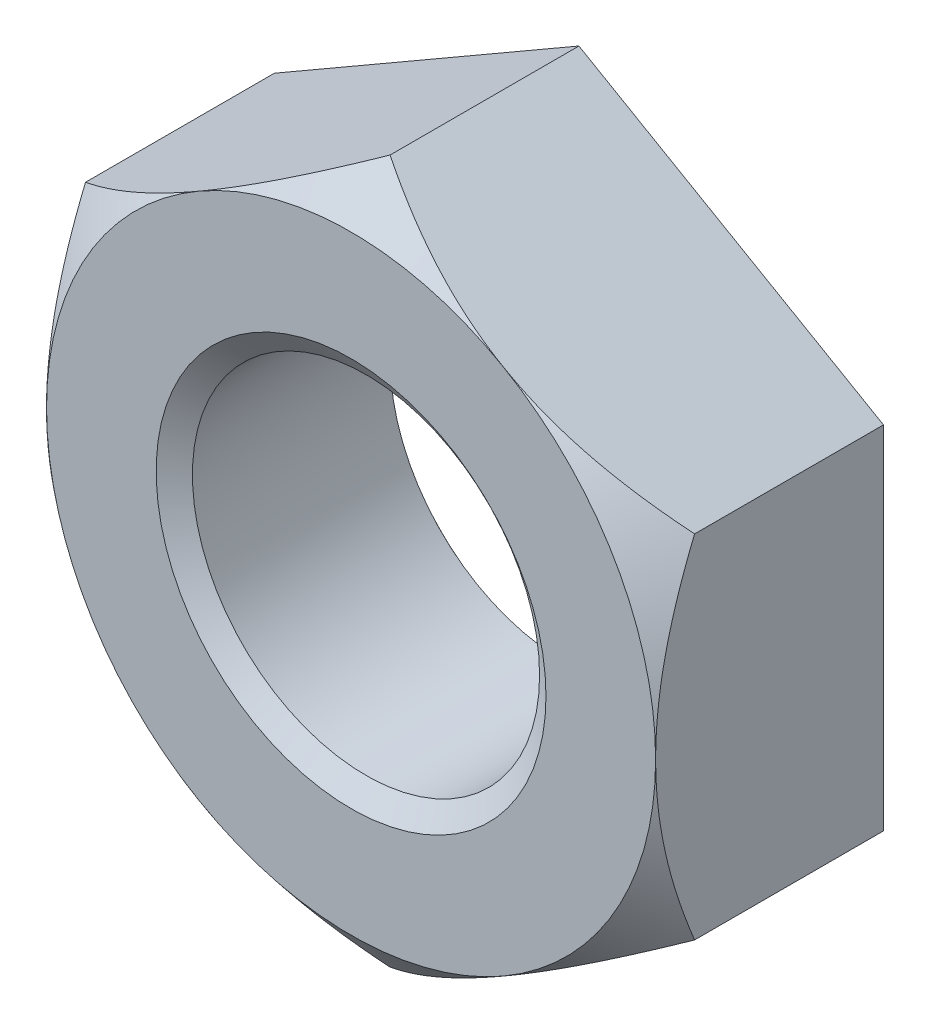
ISO-10303-21;
HEADER;
FILE_DESCRIPTION(('STEP AP214'),'2;1');
FILE_NAME('part.step','',(''),(''),'','','');
FILE_SCHEMA(('AUTOMOTIVE_DESIGN { 1 0 10303 214 1 1 1 1 }'));
ENDSEC;
DATA;
#1=APPLICATION_CONTEXT('core data for automotive mechanical design processes');
#2=APPLICATION_PROTOCOL_DEFINITION('international standard','automotive_design',2000,#1);
#3=PRODUCT_CONTEXT('',#1,'mechanical');
#4=PRODUCT('Part','Part','',(#3));
#5=PRODUCT_RELATED_PRODUCT_CATEGORY('part','',(#4));
#6=PRODUCT_DEFINITION_FORMATION('','',#4);
#7=PRODUCT_DEFINITION_CONTEXT('part definition',#1,'design');
#8=PRODUCT_DEFINITION('design','',#6,#7);
#9=PRODUCT_DEFINITION_SHAPE('','',#8);
#10=(LENGTH_UNIT() NAMED_UNIT(*) SI_UNIT(.MILLI.,.METRE.));
#11=(NAMED_UNIT(*) PLANE_ANGLE_UNIT() SI_UNIT($,.RADIAN.));
#12=(NAMED_UNIT(*) SI_UNIT($,.STERADIAN.) SOLID_ANGLE_UNIT());
#13=UNCERTAINTY_MEASURE_WITH_UNIT(LENGTH_MEASURE(1.E-05),#10,'distance_accuracy_value','');
#14=(GEOMETRIC_REPRESENTATION_CONTEXT(3) GLOBAL_UNCERTAINTY_ASSIGNED_CONTEXT((#13)) GLOBAL_UNIT_ASSIGNED_CONTEXT((#10,
#11,#12)) REPRESENTATION_CONTEXT('',''));
#15=CARTESIAN_POINT('',(0.,0.,0.));
#16=DIRECTION('',(0.,0.,1.));
#17=DIRECTION('',(1.,0.,0.));
#18=AXIS2_PLACEMENT_3D('',#15,#16,#17);
#19=CARTESIAN_POINT('',(0.,0.,-29.6926));
#20=DIRECTION('',(0.,0.,1.));
#21=DIRECTION('',(1.,0.,0.));
#22=AXIS2_PLACEMENT_3D('',#19,#20,#21);
#23=CYLINDRICAL_SURFACE('',#22,22.62124);
#24=CARTESIAN_POINT('',(0.,0.,-1.9457086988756));
#25=DIRECTION('',(0.,0.,1.));
#26=DIRECTION('',(1.,0.,0.));
#27=AXIS2_PLACEMENT_3D('',#24,#25,#26);
#28=CIRCLE('',#27,22.62124);
#29=CARTESIAN_POINT('',(22.62124,0.,-1.9457086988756));
#30=VERTEX_POINT('',#29);
#31=EDGE_CURVE('E137',#30,#30,#28,.F.);
#32=ORIENTED_EDGE('',*,*,#31,.F.);
#33=EDGE_LOOP('',(#32));
#34=FACE_BOUND('',#33,.T.);
#35=CARTESIAN_POINT('',(0.,0.,-27.7214913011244));
#36=DIRECTION('',(0.,0.,-1.));
#37=DIRECTION('',(-1.,0.,0.));
#38=AXIS2_PLACEMENT_3D('',#35,#36,#37);
#39=CIRCLE('',#38,22.62124);
#40=CARTESIAN_POINT('',(-22.62124,0.,-27.7214913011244));
#41=VERTEX_POINT('',#40);
#42=EDGE_CURVE('E44',#41,#41,#39,.F.);
#43=ORIENTED_EDGE('',*,*,#42,.F.);
#44=EDGE_LOOP('',(#43));
#45=FACE_BOUND('',#44,.T.);
#46=ADVANCED_FACE('F39',(#34,#45),#23,.F.);
#47=CARTESIAN_POINT('',(-79.3749999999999,0.,0.));
#48=DIRECTION('',(0.,0.,1.));
#49=DIRECTION('',(1.,0.,0.));
#50=AXIS2_PLACEMENT_3D('',#47,#48,#49);
#51=PLANE('',#50);
#52=CARTESIAN_POINT('',(0.,0.,0.));
#53=DIRECTION('',(0.,0.,1.));
#54=DIRECTION('',(1.,0.,0.));
#55=AXIS2_PLACEMENT_3D('',#52,#53,#54);
#56=CIRCLE('',#55,25.4);
#57=CARTESIAN_POINT('',(25.4,0.,0.));
#58=VERTEX_POINT('',#57);
#59=EDGE_CURVE('E232',#58,#58,#56,.T.);
#60=ORIENTED_EDGE('',*,*,#59,.F.);
#61=EDGE_LOOP('',(#60));
#62=FACE_BOUND('',#61,.T.);
#63=CARTESIAN_POINT('',(0.,0.,0.));
#64=DIRECTION('',(0.,0.,1.));
#65=DIRECTION('',(1.,0.,0.));
#66=AXIS2_PLACEMENT_3D('',#63,#64,#65);
#67=CIRCLE('',#66,39.6875);
#68=CARTESIAN_POINT('',(39.6875,0.,0.));
#69=VERTEX_POINT('',#68);
#70=CARTESIAN_POINT('',(19.84375,-34.3703832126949,0.));
#71=VERTEX_POINT('',#70);
#72=EDGE_CURVE('E11',#69,#71,#67,.F.);
#73=ORIENTED_EDGE('',*,*,#72,.F.);
#74=CARTESIAN_POINT('',(0.,0.,0.));
#75=DIRECTION('',(0.,0.,1.));
#76=DIRECTION('',(1.,0.,0.));
#77=AXIS2_PLACEMENT_3D('',#74,#75,#76);
#78=CIRCLE('',#77,39.6875);
#79=CARTESIAN_POINT('',(19.8437500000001,34.3703832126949,0.));
#80=VERTEX_POINT('',#79);
#81=EDGE_CURVE('E129',#69,#80,#78,.T.);
#82=ORIENTED_EDGE('',*,*,#81,.T.);
#83=CARTESIAN_POINT('',(-19.84375,34.3703832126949,0.));
#84=VERTEX_POINT('',#83);
#85=EDGE_CURVE('E51',#84,#80,#67,.F.);
#86=ORIENTED_EDGE('',*,*,#85,.F.);
#87=CARTESIAN_POINT('',(-39.6875,0.,0.));
#88=VERTEX_POINT('',#87);
#89=EDGE_CURVE('E286',#88,#84,#67,.F.);
#90=ORIENTED_EDGE('',*,*,#89,.F.);
#91=CARTESIAN_POINT('',(-19.84375,-34.3703832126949,0.));
#92=VERTEX_POINT('',#91);
#93=EDGE_CURVE('E288',#92,#88,#67,.F.);
#94=ORIENTED_EDGE('',*,*,#93,.F.);
#95=EDGE_CURVE('E49',#71,#92,#67,.F.);
#96=ORIENTED_EDGE('',*,*,#95,.F.);
#97=EDGE_LOOP('',(#73,#82,#86,#90,#94,#96));
#98=FACE_BOUND('',#97,.T.);
#99=ADVANCED_FACE('F139',(#62,#98),#51,.T.);
#100=CARTESIAN_POINT('',(0.,45.8271776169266,-29.6926));
#101=DIRECTION('',(-0.500000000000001,0.866025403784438,0.));
#102=DIRECTION('',(-0.866025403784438,-0.500000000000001,0.));
#103=AXIS2_PLACEMENT_3D('',#100,#101,#102);
#104=PLANE('',#103);
#105=CARTESIAN_POINT('',(0.000200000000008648,45.8272930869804,-5.08009554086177));
#106=CARTESIAN_POINT('',(-0.675362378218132,45.4372569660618,-4.75740980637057));
#107=CARTESIAN_POINT('',(-1.3547569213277,45.0450083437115,-4.44518483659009));
#108=CARTESIAN_POINT('',(-2.72161040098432,44.255855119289,-3.8444644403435));
#109=CARTESIAN_POINT('',(-3.40907190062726,43.8589490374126,-3.55597680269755));
#110=CARTESIAN_POINT('',(-4.79420473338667,43.0592422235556,-3.00488379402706));
#111=CARTESIAN_POINT('',(-5.49190147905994,42.6564268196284,-2.74236315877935));
#112=CARTESIAN_POINT('',(-6.89523688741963,41.8462107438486,-2.24748448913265));
#113=CARTESIAN_POINT('',(-7.60087484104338,41.4388104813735,-2.0151237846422));
#114=CARTESIAN_POINT('',(-9.01334120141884,40.6233226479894,-1.58581833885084));
#115=CARTESIAN_POINT('',(-9.72010005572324,40.2152752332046,-1.38856992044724));
#116=CARTESIAN_POINT('',(-11.1404844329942,39.3952159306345,-1.03010323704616));
#117=CARTESIAN_POINT('',(-11.8541100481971,38.9832039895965,-0.868885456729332));
#118=CARTESIAN_POINT('',(-13.2863448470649,38.1563028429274,-0.585602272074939));
#119=CARTESIAN_POINT('',(-14.0049472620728,37.7414175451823,-0.463491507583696));
#120=CARTESIAN_POINT('',(-15.446538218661,36.9091146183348,-0.260639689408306));
#121=CARTESIAN_POINT('',(-16.1695267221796,36.4916970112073,-0.179898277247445));
#122=CARTESIAN_POINT('',(-17.630331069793,35.6483012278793,-0.0605545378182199));
#123=CARTESIAN_POINT('',(-18.368192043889,35.2222969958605,-0.0226825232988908));
#124=CARTESIAN_POINT('',(-19.8446204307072,34.3698806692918,0.00757152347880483));
#125=CARTESIAN_POINT('',(-20.5831878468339,33.9434685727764,-4.66645945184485E-05));
#126=CARTESIAN_POINT('',(-22.059242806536,33.0912678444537,-0.0606042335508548));
#127=CARTESIAN_POINT('',(-22.7967297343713,32.6654795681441,-0.113563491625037));
#128=CARTESIAN_POINT('',(-24.2683079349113,31.8158634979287,-0.263592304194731));
#129=CARTESIAN_POINT('',(-25.0023992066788,31.3920357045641,-0.360661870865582));
#130=CARTESIAN_POINT('',(-26.465573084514,30.5472718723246,-0.596784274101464));
#131=CARTESIAN_POINT('',(-27.194654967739,30.1263362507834,-0.735843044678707));
#132=CARTESIAN_POINT('',(-28.6463836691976,29.288180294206,-1.05312836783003));
#133=CARTESIAN_POINT('',(-29.3690302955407,28.8709600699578,-1.23135608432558));
#134=CARTESIAN_POINT('',(-30.8067522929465,28.0408908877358,-1.62370548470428));
#135=CARTESIAN_POINT('',(-31.5218294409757,27.6280409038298,-1.83781853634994));
#136=CARTESIAN_POINT('',(-32.944072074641,26.8069087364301,-2.2985964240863));
#137=CARTESIAN_POINT('',(-33.6512373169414,26.3986266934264,-2.54526225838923));
#138=CARTESIAN_POINT('',(-34.8062681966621,25.7317693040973,-2.97446619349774));
#139=CARTESIAN_POINT('',(-35.2565422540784,25.471803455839,-3.14844506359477));
#140=CARTESIAN_POINT('',(-36.1535852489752,24.9538954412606,-3.50755980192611));
#141=CARTESIAN_POINT('',(-36.6003552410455,24.695952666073,-3.69269215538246));
#142=CARTESIAN_POINT('',(-37.4890449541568,24.1828674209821,-4.07269340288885));
#143=CARTESIAN_POINT('',(-37.9309759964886,23.9277184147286,-4.26752708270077));
#144=CARTESIAN_POINT('',(-38.811702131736,23.4192309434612,-4.66680287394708));
#145=CARTESIAN_POINT('',(-39.2504964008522,23.1658929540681,-4.87124740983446));
#146=CARTESIAN_POINT('',(-39.6877,22.9134733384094,-5.08009554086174));
#147=B_SPLINE_CURVE_WITH_KNOTS('',3,(#105,#106,#107,#108,#109,#110,#111,#112,#113,#114,#115,
#116,#117,#118,#119,#120,#121,#122,#123,#124,#125,#126,#127,#128,#129,#130,#131,#132,#133,#134,
#135,#136,#137,#138,#139,#140,#141,#142,#143,#144,#145,#146),.UNSPECIFIED.,.F.,.F.,(4,2,2,2,2,2,
2,2,2,2,2,2,2,2,2,2,2,2,2,2,4),(0.,2.53259620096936,5.06602012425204,7.60745580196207,
10.1486663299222,12.6667002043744,15.1847679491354,17.6999043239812,20.2150189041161,
22.7723642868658,25.329722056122,27.888201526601,30.4466817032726,33.0055236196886,
35.5644415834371,38.1227448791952,40.6811266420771,42.3258117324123,43.9699812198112,
45.608565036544,47.2475644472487),.UNSPECIFIED.);
#148=CARTESIAN_POINT('',(0.,45.8271776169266,-5.08));
#149=VERTEX_POINT('',#148);
#150=EDGE_CURVE('E193',#149,#84,#147,.T.);
#151=ORIENTED_EDGE('',*,*,#150,.F.);
#152=DIRECTION('',(0.,0.,1.));
#153=VECTOR('',#152,1.);
#154=CARTESIAN_POINT('',(0.,45.8271776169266,-29.6926));
#155=LINE('',#154,#153);
#156=CARTESIAN_POINT('',(0.,45.8271776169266,-29.6926));
#157=VERTEX_POINT('',#156);
#158=EDGE_CURVE('E256',#157,#149,#155,.T.);
#159=ORIENTED_EDGE('',*,*,#158,.F.);
#160=DIRECTION('',(-0.866025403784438,-0.500000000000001,0.));
#161=VECTOR('',#160,1.);
#162=CARTESIAN_POINT('',(0.,45.8271776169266,-29.6926));
#163=LINE('',#162,#161);
#164=CARTESIAN_POINT('',(-39.6875,22.9135888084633,-29.6926));
#165=VERTEX_POINT('',#164);
#166=EDGE_CURVE('E145',#157,#165,#163,.T.);
#167=ORIENTED_EDGE('',*,*,#166,.T.);
#168=DIRECTION('',(0.,0.,1.));
#169=VECTOR('',#168,1.);
#170=CARTESIAN_POINT('',(-39.6875,22.9135888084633,-29.6926));
#171=LINE('',#170,#169);
#172=CARTESIAN_POINT('',(-39.6875,22.9135888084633,-5.08));
#173=VERTEX_POINT('',#172);
#174=EDGE_CURVE('E243',#165,#173,#171,.T.);
#175=ORIENTED_EDGE('',*,*,#174,.T.);
#176=EDGE_CURVE('E187',#84,#173,#147,.T.);
#177=ORIENTED_EDGE('',*,*,#176,.F.);
#178=EDGE_LOOP('',(#151,#159,#167,#175,#177));
#179=FACE_BOUND('',#178,.T.);
#180=ADVANCED_FACE('F41',(#179),#104,.T.);
#181=CARTESIAN_POINT('',(39.6875,22.9135888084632,-29.6926));
#182=DIRECTION('',(0.500000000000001,0.866025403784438,0.));
#183=DIRECTION('',(-0.866025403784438,0.500000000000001,0.));
#184=AXIS2_PLACEMENT_3D('',#181,#182,#183);
#185=PLANE('',#184);
#186=CARTESIAN_POINT('',(39.6877,22.9134733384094,-5.08009554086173));
#187=CARTESIAN_POINT('',(39.0121376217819,23.303509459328,-4.75740980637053));
#188=CARTESIAN_POINT('',(38.3327430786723,23.6957580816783,-4.44518483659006));
#189=CARTESIAN_POINT('',(36.9658895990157,24.4849113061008,-3.84446444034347));
#190=CARTESIAN_POINT('',(36.2784280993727,24.8818173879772,-3.55597680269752));
#191=CARTESIAN_POINT('',(34.8932952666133,25.6815242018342,-3.00488379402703));
#192=CARTESIAN_POINT('',(34.1955985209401,26.0843396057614,-2.74236315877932));
#193=CARTESIAN_POINT('',(32.7922631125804,26.8945556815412,-2.24748448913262));
#194=CARTESIAN_POINT('',(32.0866251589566,27.3019559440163,-2.01512378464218));
#195=CARTESIAN_POINT('',(30.6741587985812,28.1174437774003,-1.58581833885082));
#196=CARTESIAN_POINT('',(29.9673999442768,28.5254911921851,-1.38856992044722));
#197=CARTESIAN_POINT('',(28.5470155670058,29.3455504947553,-1.03010323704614));
#198=CARTESIAN_POINT('',(27.8333899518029,29.7575624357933,-0.868885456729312));
#199=CARTESIAN_POINT('',(26.4011551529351,30.5844635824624,-0.585602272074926));
#200=CARTESIAN_POINT('',(25.6825527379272,30.9993488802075,-0.463491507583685));
#201=CARTESIAN_POINT('',(24.240961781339,31.831651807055,-0.260639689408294));
#202=CARTESIAN_POINT('',(23.5179732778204,32.2490694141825,-0.179898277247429));
#203=CARTESIAN_POINT('',(22.057168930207,33.0924651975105,-0.0605545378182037));
#204=CARTESIAN_POINT('',(21.3193079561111,33.5184694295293,-0.0226825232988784));
#205=CARTESIAN_POINT('',(19.8428795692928,34.370885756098,0.00757152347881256));
#206=CARTESIAN_POINT('',(19.1043121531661,34.7972978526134,-4.66645945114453E-05));
#207=CARTESIAN_POINT('',(17.628257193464,35.6494985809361,-0.0606042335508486));
#208=CARTESIAN_POINT('',(16.8907702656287,36.0752868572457,-0.11356349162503));
#209=CARTESIAN_POINT('',(15.4191920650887,36.924902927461,-0.263592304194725));
#210=CARTESIAN_POINT('',(14.6851007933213,37.3487307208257,-0.360661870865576));
#211=CARTESIAN_POINT('',(13.221926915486,38.1934945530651,-0.59678427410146));
#212=CARTESIAN_POINT('',(12.492845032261,38.6144301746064,-0.735843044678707));
#213=CARTESIAN_POINT('',(11.0411163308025,39.4525861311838,-1.05312836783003));
#214=CARTESIAN_POINT('',(10.3184697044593,39.869806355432,-1.23135608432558));
#215=CARTESIAN_POINT('',(8.88074770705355,40.699875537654,-1.62370548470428));
#216=CARTESIAN_POINT('',(8.16567055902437,41.11272552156,-1.83781853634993));
#217=CARTESIAN_POINT('',(6.74342792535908,41.9338576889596,-2.2985964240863));
#218=CARTESIAN_POINT('',(6.03626268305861,42.3421397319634,-2.54526225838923));
#219=CARTESIAN_POINT('',(4.8812318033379,43.0089971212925,-2.97446619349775));
#220=CARTESIAN_POINT('',(4.43095774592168,43.2689629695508,-3.14844506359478));
#221=CARTESIAN_POINT('',(3.53391475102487,43.7868709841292,-3.50755980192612));
#222=CARTESIAN_POINT('',(3.08714475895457,44.0448137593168,-3.69269215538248));
#223=CARTESIAN_POINT('',(2.19845504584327,44.5578990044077,-4.07269340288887));
#224=CARTESIAN_POINT('',(1.75652400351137,44.8130480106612,-4.26752708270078));
#225=CARTESIAN_POINT('',(0.875797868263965,45.3215354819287,-4.6668028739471));
#226=CARTESIAN_POINT('',(0.437003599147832,45.5748734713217,-4.87124740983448));
#227=CARTESIAN_POINT('',(-0.000199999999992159,45.8272930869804,-5.08009554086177));
#228=B_SPLINE_CURVE_WITH_KNOTS('',3,(#186,#187,#188,#189,#190,#191,#192,#193,#194,#195,#196,
#197,#198,#199,#200,#201,#202,#203,#204,#205,#206,#207,#208,#209,#210,#211,#212,#213,#214,#215,
#216,#217,#218,#219,#220,#221,#222,#223,#224,#225,#226,#227),.UNSPECIFIED.,.F.,.F.,(4,2,2,2,2,2,
2,2,2,2,2,2,2,2,2,2,2,2,2,2,4),(0.,2.53259620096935,5.06602012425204,7.60745580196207,
10.1486663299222,12.6667002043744,15.1847679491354,17.6999043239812,20.2150189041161,
22.7723642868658,25.329722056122,27.888201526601,30.4466817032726,33.0055236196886,
35.5644415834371,38.1227448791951,40.681126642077,42.3258117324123,43.9699812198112,
45.608565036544,47.2475644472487),.UNSPECIFIED.);
#229=CARTESIAN_POINT('',(39.6875,22.9135888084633,-5.08));
#230=VERTEX_POINT('',#229);
#231=EDGE_CURVE('E132',#230,#80,#228,.T.);
#232=ORIENTED_EDGE('',*,*,#231,.F.);
#233=DIRECTION('',(0.,0.,1.));
#234=VECTOR('',#233,1.);
#235=CARTESIAN_POINT('',(39.6875,22.9135888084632,-29.6926));
#236=LINE('',#235,#234);
#237=CARTESIAN_POINT('',(39.6875,22.9135888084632,-29.6926));
#238=VERTEX_POINT('',#237);
#239=EDGE_CURVE('E144',#238,#230,#236,.T.);
#240=ORIENTED_EDGE('',*,*,#239,.F.);
#241=DIRECTION('',(-0.866025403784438,0.500000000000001,0.));
#242=VECTOR('',#241,1.);
#243=CARTESIAN_POINT('',(39.6875,22.9135888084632,-29.6926));
#244=LINE('',#243,#242);
#245=EDGE_CURVE('E247',#238,#157,#244,.T.);
#246=ORIENTED_EDGE('',*,*,#245,.T.);
#247=ORIENTED_EDGE('',*,*,#158,.T.);
#248=EDGE_CURVE('E156',#80,#149,#228,.T.);
#249=ORIENTED_EDGE('',*,*,#248,.F.);
#250=EDGE_LOOP('',(#232,#240,#246,#247,#249));
#251=FACE_BOUND('',#250,.T.);
#252=ADVANCED_FACE('F172',(#251),#185,.T.);
#253=CARTESIAN_POINT('',(39.6875,22.9135888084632,-29.6926));
#254=DIRECTION('',(-1.,0.,0.));
#255=DIRECTION('',(0.,-1.,0.));
#256=AXIS2_PLACEMENT_3D('',#253,#254,#255);
#257=PLANE('',#256);
#258=ORIENTED_EDGE('',*,*,#239,.T.);
#259=CARTESIAN_POINT('',(39.6875,-51.6328225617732,-21.0457198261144));
#260=CARTESIAN_POINT('',(39.6875,-50.9711763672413,-20.6116874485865));
#261=CARTESIAN_POINT('',(39.6875,-50.3081162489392,-20.1798041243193));
#262=CARTESIAN_POINT('',(39.6875,-48.9789178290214,-19.3207795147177));
#263=CARTESIAN_POINT('',(39.6875,-48.3127794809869,-18.8936383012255));
#264=CARTESIAN_POINT('',(39.6875,-46.9770520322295,-18.0444645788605));
#265=CARTESIAN_POINT('',(39.6875,-46.3074622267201,-17.6224331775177));
#266=CARTESIAN_POINT('',(39.6875,-44.9647085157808,-16.7841033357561));
#267=CARTESIAN_POINT('',(39.6875,-44.2915446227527,-16.3678048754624));
#268=CARTESIAN_POINT('',(39.6875,-42.2568910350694,-15.1226295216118));
#269=CARTESIAN_POINT('',(39.6875,-40.8894876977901,-14.303373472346));
#270=CARTESIAN_POINT('',(39.6875,-38.1364157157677,-12.6961963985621));
#271=CARTESIAN_POINT('',(39.6875,-36.7507482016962,-11.9082734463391));
#272=CARTESIAN_POINT('',(39.6875,-34.6202465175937,-10.7357414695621));
#273=CARTESIAN_POINT('',(39.6875,-33.883142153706,-10.3370700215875));
#274=CARTESIAN_POINT('',(39.6875,-32.4025093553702,-9.5518101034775));
#275=CARTESIAN_POINT('',(39.6875,-31.6589809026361,-9.1652216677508));
#276=CARTESIAN_POINT('',(39.6875,-30.1648802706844,-8.40558030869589));
#277=CARTESIAN_POINT('',(39.6875,-29.4143069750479,-8.03252957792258));
#278=CARTESIAN_POINT('',(39.6875,-27.9057210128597,-7.30176643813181));
#279=CARTESIAN_POINT('',(39.6875,-27.1477083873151,-6.94405394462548));
#280=CARTESIAN_POINT('',(39.6875,-25.6257322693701,-6.24685408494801));
#281=CARTESIAN_POINT('',(39.6875,-24.8617895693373,-5.9073214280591));
#282=CARTESIAN_POINT('',(39.6875,-23.3255198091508,-5.24768587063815));
#283=CARTESIAN_POINT('',(39.6875,-22.5531925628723,-4.92758340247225));
#284=CARTESIAN_POINT('',(39.6875,-21.0000557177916,-4.30940863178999));
#285=CARTESIAN_POINT('',(39.6875,-20.2192491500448,-4.01132873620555));
#286=CARTESIAN_POINT('',(39.6875,-18.6486688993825,-3.43983380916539));
#287=CARTESIAN_POINT('',(39.6875,-17.8588956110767,-3.16641769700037));
#288=CARTESIAN_POINT('',(39.6875,-16.2782209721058,-2.64980510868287));
#289=CARTESIAN_POINT('',(39.6875,-15.4874096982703,-2.40633404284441));
#290=CARTESIAN_POINT('',(39.6875,-13.8971196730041,-1.949521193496));
#291=CARTESIAN_POINT('',(39.6875,-13.0976411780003,-1.73617852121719));
#292=CARTESIAN_POINT('',(39.6875,-11.490505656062,-1.34270689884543));
#293=CARTESIAN_POINT('',(39.6875,-10.6828485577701,-1.16257823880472));
#294=CARTESIAN_POINT('',(39.6875,-9.06026613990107,-0.838523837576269));
#295=CARTESIAN_POINT('',(39.6875,-8.24534084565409,-0.694597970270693));
#296=CARTESIAN_POINT('',(39.6875,-6.62443803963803,-0.44789053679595));
#297=CARTESIAN_POINT('',(39.6875,-5.81856783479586,-0.344407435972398));
#298=CARTESIAN_POINT('',(39.6875,-4.20271348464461,-0.176943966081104));
#299=CARTESIAN_POINT('',(39.6875,-3.39272937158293,-0.112963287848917));
#300=CARTESIAN_POINT('',(39.6875,-1.77060014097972,-0.0258418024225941));
#301=CARTESIAN_POINT('',(39.6875,-0.958455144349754,-0.00269875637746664));
#302=CARTESIAN_POINT('',(39.6875,0.665955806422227,0.00225284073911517));
#303=CARTESIAN_POINT('',(39.6875,1.47822175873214,-0.0159380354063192));
#304=CARTESIAN_POINT('',(39.6875,3.04262978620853,-0.0904816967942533));
#305=CARTESIAN_POINT('',(39.6875,3.79490888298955,-0.144006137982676));
#306=CARTESIAN_POINT('',(39.6875,5.29621422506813,-0.285354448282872));
#307=CARTESIAN_POINT('',(39.6875,6.04524051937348,-0.373177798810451));
#308=CARTESIAN_POINT('',(39.6875,7.53870946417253,-0.581619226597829));
#309=CARTESIAN_POINT('',(39.6875,8.28315200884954,-0.70223805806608));
#310=CARTESIAN_POINT('',(39.6875,9.76635407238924,-0.974351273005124));
#311=CARTESIAN_POINT('',(39.6875,10.5051135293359,-1.125845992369));
#312=CARTESIAN_POINT('',(39.6875,11.9915712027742,-1.4610042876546));
#313=CARTESIAN_POINT('',(39.6875,12.739131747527,-1.64527612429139));
#314=CARTESIAN_POINT('',(39.6875,14.22692970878,-2.04125829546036));
#315=CARTESIAN_POINT('',(39.6875,14.9671670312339,-2.25296898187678));
#316=CARTESIAN_POINT('',(39.6875,16.4398374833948,-2.70128400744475));
#317=CARTESIAN_POINT('',(39.6875,17.1722725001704,-2.93788216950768));
#318=CARTESIAN_POINT('',(39.6875,18.6294175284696,-3.43359252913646));
#319=CARTESIAN_POINT('',(39.6875,19.3541279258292,-3.6927035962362));
#320=CARTESIAN_POINT('',(39.6875,20.8232310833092,-4.24136165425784));
#321=CARTESIAN_POINT('',(39.6875,21.5673316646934,-4.53168910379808));
#322=CARTESIAN_POINT('',(39.6875,23.0476598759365,-5.13183376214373));
#323=CARTESIAN_POINT('',(39.6875,23.7838870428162,-5.44165210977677));
#324=CARTESIAN_POINT('',(39.6875,25.2489982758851,-6.07874085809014));
#325=CARTESIAN_POINT('',(39.6875,25.9778800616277,-6.4060164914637));
#326=CARTESIAN_POINT('',(39.6875,27.4284730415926,-7.07603037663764));
#327=CARTESIAN_POINT('',(39.6875,28.150184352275,-7.41876837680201));
#328=CARTESIAN_POINT('',(39.6875,29.5878108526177,-8.11847594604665));
#329=CARTESIAN_POINT('',(39.6875,30.3037174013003,-8.47546323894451));
#330=CARTESIAN_POINT('',(39.6875,31.7292596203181,-9.20177066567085));
#331=CARTESIAN_POINT('',(39.6875,32.4388951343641,-9.57109110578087));
#332=CARTESIAN_POINT('',(39.6875,33.8522184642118,-10.3206859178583));
#333=CARTESIAN_POINT('',(39.6875,34.5559071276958,-10.7009586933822));
#334=CARTESIAN_POINT('',(39.6875,35.9578716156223,-11.4713640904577));
#335=CARTESIAN_POINT('',(39.6875,36.6561473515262,-11.8614968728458));
#336=CARTESIAN_POINT('',(39.6875,38.7525009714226,-13.0502493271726));
#337=CARTESIAN_POINT('',(39.6875,40.1429535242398,-13.8623368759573));
#338=CARTESIAN_POINT('',(39.6875,42.9065478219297,-15.5153833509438));
#339=CARTESIAN_POINT('',(39.6875,44.2796891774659,-16.3563429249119));
#340=CARTESIAN_POINT('',(39.6875,47.0102618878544,-18.0612949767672));
#341=CARTESIAN_POINT('',(39.6875,48.3677033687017,-18.9252712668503));
#342=CARTESIAN_POINT('',(39.6875,51.0699566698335,-20.6726859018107));
#343=CARTESIAN_POINT('',(39.6875,52.4147686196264,-21.5561240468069));
#344=CARTESIAN_POINT('',(39.6875,54.9416289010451,-23.2381057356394));
#345=CARTESIAN_POINT('',(39.6875,56.124835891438,-24.0349116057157));
#346=CARTESIAN_POINT('',(39.6875,58.4837915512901,-25.6394756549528));
#347=CARTESIAN_POINT('',(39.6875,59.6595402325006,-26.447233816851));
#348=CARTESIAN_POINT('',(39.6875,62.004680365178,-28.0723416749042));
#349=CARTESIAN_POINT('',(39.6875,63.1740707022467,-28.8896929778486));
#350=CARTESIAN_POINT('',(39.6875,65.5070659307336,-30.5326124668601));
#351=CARTESIAN_POINT('',(39.6875,66.6706708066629,-31.358180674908));
#352=CARTESIAN_POINT('',(39.6875,68.9768909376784,-33.0051660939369));
#353=CARTESIAN_POINT('',(39.6875,70.1195757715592,-33.8264859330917));
#354=CARTESIAN_POINT('',(39.6875,72.4005033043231,-35.475271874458));
#355=CARTESIAN_POINT('',(39.6875,73.5387459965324,-36.3027379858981));
#356=CARTESIAN_POINT('',(39.6875,75.8109571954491,-37.9628759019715));
#357=CARTESIAN_POINT('',(39.6875,76.9449267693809,-38.795546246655));
#358=CARTESIAN_POINT('',(39.6875,79.2092896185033,-40.4657187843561));
#359=CARTESIAN_POINT('',(39.6875,80.3396829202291,-41.3032209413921));
#360=CARTESIAN_POINT('',(39.6875,81.468491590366,-42.1428481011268));
#361=B_SPLINE_CURVE_WITH_KNOTS('',3,(#259,#260,#261,#262,#263,#264,#265,#266,#267,#268,#269,
#270,#271,#272,#273,#274,#275,#276,#277,#278,#279,#280,#281,#282,#283,#284,#285,#286,#287,#288,
#289,#290,#291,#292,#293,#294,#295,#296,#297,#298,#299,#300,#301,#302,#303,#304,#305,#306,#307,
#308,#309,#310,#311,#312,#313,#314,#315,#316,#317,#318,#319,#320,#321,#322,#323,#324,#325,#326,
#327,#328,#329,#330,#331,#332,#333,#334,#335,#336,#337,#338,#339,#340,#341,#342,#343,#344,#345,
#346,#347,#348,#349,#350,#351,#352,#353,#354,#355,#356,#357,#358,#359,#360),.UNSPECIFIED.,.F.,
.F.,(4,2,2,2,2,2,2,2,2,2,2,2,2,2,2,2,2,2,2,2,2,2,2,2,2,2,2,2,2,2,2,2,2,2,2,2,2,2,2,2,2,2,2,2,2,
2,2,2,2,2,4),(0.,2.37390854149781,4.74785299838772,7.12230310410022,9.49674497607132,
14.2785351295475,19.060030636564,21.5739708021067,24.0879181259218,26.6022708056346,
29.1166096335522,31.6243614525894,34.1321690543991,36.6391079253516,39.1459368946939,
41.6277244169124,44.1094387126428,46.59117467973,49.0729020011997,51.5094354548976,
53.9459498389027,56.3823306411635,58.8186776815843,61.0804212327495,63.3421305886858,
65.6038919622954,67.8656779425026,70.1749197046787,72.4841910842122,74.7928906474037,
77.101474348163,79.4973670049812,81.8933997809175,84.2901548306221,86.6868708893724,
89.0866671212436,91.4865229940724,93.8860308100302,96.2855777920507,101.11578528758,
105.946101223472,110.773105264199,115.600059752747,119.87946643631,124.158866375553,
128.438993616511,132.719132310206,136.940798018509,141.162470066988,145.383006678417,
149.603511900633),.UNSPECIFIED.);
#362=EDGE_CURVE('E124',#230,#69,#361,.F.);
#363=ORIENTED_EDGE('',*,*,#362,.T.);
#364=CARTESIAN_POINT('',(39.6875,-22.9135888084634,-5.08));
#365=VERTEX_POINT('',#364);
#366=EDGE_CURVE('E113',#69,#365,#361,.F.);
#367=ORIENTED_EDGE('',*,*,#366,.T.);
#368=DIRECTION('',(0.,0.,1.));
#369=VECTOR('',#368,1.);
#370=CARTESIAN_POINT('',(39.6875,-22.9135888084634,-29.6926));
#371=LINE('',#370,#369);
#372=CARTESIAN_POINT('',(39.6875,-22.9135888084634,-29.6926));
#373=VERTEX_POINT('',#372);
#374=EDGE_CURVE('E253',#373,#365,#371,.T.);
#375=ORIENTED_EDGE('',*,*,#374,.F.);
#376=DIRECTION('',(0.,-1.,0.));
#377=VECTOR('',#376,1.);
#378=CARTESIAN_POINT('',(39.6875,22.9135888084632,-29.6926));
#379=LINE('',#378,#377);
#380=EDGE_CURVE('E261',#238,#373,#379,.T.);
#381=ORIENTED_EDGE('',*,*,#380,.F.);
#382=EDGE_LOOP('',(#258,#363,#367,#375,#381));
#383=FACE_BOUND('',#382,.T.);
#384=ADVANCED_FACE('F142',(#383),#257,.F.);
#385=CARTESIAN_POINT('',(0.,-45.8271776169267,-29.6926));
#386=DIRECTION('',(0.500000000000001,-0.866025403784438,0.));
#387=DIRECTION('',(0.866025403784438,0.500000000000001,0.));
#388=AXIS2_PLACEMENT_3D('',#385,#386,#387);
#389=PLANE('',#388);
#390=CARTESIAN_POINT('',(-0.000200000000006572,-45.8272930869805,-5.08009554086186));
#391=CARTESIAN_POINT('',(0.675362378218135,-45.4372569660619,-4.75740980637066));
#392=CARTESIAN_POINT('',(1.3547569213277,-45.0450083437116,-4.44518483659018));
#393=CARTESIAN_POINT('',(2.72161040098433,-44.2558551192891,-3.84446444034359));
#394=CARTESIAN_POINT('',(3.40907190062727,-43.8589490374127,-3.55597680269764));
#395=CARTESIAN_POINT('',(4.79420473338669,-43.0592422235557,-3.00488379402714));
#396=CARTESIAN_POINT('',(5.49190147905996,-42.6564268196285,-2.74236315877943));
#397=CARTESIAN_POINT('',(6.89523688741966,-41.8462107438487,-2.24748448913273));
#398=CARTESIAN_POINT('',(7.60087484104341,-41.4388104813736,-2.01512378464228));
#399=CARTESIAN_POINT('',(9.01334120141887,-40.6233226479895,-1.58581833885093));
#400=CARTESIAN_POINT('',(9.72010005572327,-40.2152752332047,-1.38856992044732));
#401=CARTESIAN_POINT('',(11.1404844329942,-39.3952159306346,-1.03010323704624));
#402=CARTESIAN_POINT('',(11.8541100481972,-38.9832039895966,-0.868885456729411));
#403=CARTESIAN_POINT('',(13.2863448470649,-38.1563028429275,-0.585602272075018));
#404=CARTESIAN_POINT('',(14.0049472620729,-37.7414175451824,-0.463491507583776));
#405=CARTESIAN_POINT('',(15.446538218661,-36.9091146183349,-0.260639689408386));
#406=CARTESIAN_POINT('',(16.1695267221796,-36.4916970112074,-0.179898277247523));
#407=CARTESIAN_POINT('',(17.6303310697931,-35.6483012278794,-0.0605545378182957));
#408=CARTESIAN_POINT('',(18.368192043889,-35.2222969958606,-0.0226825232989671));
#409=CARTESIAN_POINT('',(19.8446204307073,-34.3698806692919,0.00757152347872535));
#410=CARTESIAN_POINT('',(20.583187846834,-33.9434685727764,-4.66645946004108E-05));
#411=CARTESIAN_POINT('',(22.059242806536,-33.0912678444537,-0.0606042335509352));
#412=CARTESIAN_POINT('',(22.7967297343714,-32.6654795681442,-0.113563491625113));
#413=CARTESIAN_POINT('',(24.2683079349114,-31.8158634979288,-0.26359230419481));
#414=CARTESIAN_POINT('',(25.0023992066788,-31.3920357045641,-0.360661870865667));
#415=CARTESIAN_POINT('',(26.4655730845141,-30.5472718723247,-0.596784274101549));
#416=CARTESIAN_POINT('',(27.1946549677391,-30.1263362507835,-0.735843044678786));
#417=CARTESIAN_POINT('',(28.6463836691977,-29.2881802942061,-1.0531283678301));
#418=CARTESIAN_POINT('',(29.3690302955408,-28.8709600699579,-1.23135608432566));
#419=CARTESIAN_POINT('',(30.8067522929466,-28.0408908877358,-1.62370548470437));
#420=CARTESIAN_POINT('',(31.5218294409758,-27.6280409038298,-1.83781853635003));
#421=CARTESIAN_POINT('',(32.9440720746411,-26.8069087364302,-2.2985964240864));
#422=CARTESIAN_POINT('',(33.6512373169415,-26.3986266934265,-2.54526225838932));
#423=CARTESIAN_POINT('',(34.8062681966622,-25.7317693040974,-2.97446619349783));
#424=CARTESIAN_POINT('',(35.2565422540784,-25.471803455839,-3.14844506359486));
#425=CARTESIAN_POINT('',(36.1535852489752,-24.9538954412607,-3.50755980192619));
#426=CARTESIAN_POINT('',(36.6003552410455,-24.6959526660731,-3.69269215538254));
#427=CARTESIAN_POINT('',(37.4890449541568,-24.1828674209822,-4.07269340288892));
#428=CARTESIAN_POINT('',(37.9309759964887,-23.9277184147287,-4.26752708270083));
#429=CARTESIAN_POINT('',(38.8117021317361,-23.4192309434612,-4.66680287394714));
#430=CARTESIAN_POINT('',(39.2504964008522,-23.1658929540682,-4.87124740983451));
#431=CARTESIAN_POINT('',(39.6877,-22.9134733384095,-5.08009554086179));
#432=B_SPLINE_CURVE_WITH_KNOTS('',3,(#390,#391,#392,#393,#394,#395,#396,#397,#398,#399,#400,
#401,#402,#403,#404,#405,#406,#407,#408,#409,#410,#411,#412,#413,#414,#415,#416,#417,#418,#419,
#420,#421,#422,#423,#424,#425,#426,#427,#428,#429,#430,#431),.UNSPECIFIED.,.F.,.F.,(4,2,2,2,2,2,
2,2,2,2,2,2,2,2,2,2,2,2,2,2,4),(0.,2.53259620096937,5.06602012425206,7.6074558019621,
10.1486663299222,12.6667002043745,15.1847679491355,17.6999043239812,20.2150189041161,
22.7723642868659,25.3297220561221,27.8882015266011,30.4466817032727,33.0055236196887,
35.5644415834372,38.1227448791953,40.6811266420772,42.3258117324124,43.9699812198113,
45.6085650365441,47.2475644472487),.UNSPECIFIED.);
#433=CARTESIAN_POINT('',(-1.97758476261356E-13,-45.8271776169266,-5.08));
#434=VERTEX_POINT('',#433);
#435=EDGE_CURVE('E58',#434,#71,#432,.T.);
#436=ORIENTED_EDGE('',*,*,#435,.F.);
#437=DIRECTION('',(0.,0.,1.));
#438=VECTOR('',#437,1.);
#439=CARTESIAN_POINT('',(0.,-45.8271776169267,-29.6926));
#440=LINE('',#439,#438);
#441=CARTESIAN_POINT('',(0.,-45.8271776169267,-29.6926));
#442=VERTEX_POINT('',#441);
#443=EDGE_CURVE('E250',#442,#434,#440,.T.);
#444=ORIENTED_EDGE('',*,*,#443,.F.);
#445=DIRECTION('',(0.866025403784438,0.500000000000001,0.));
#446=VECTOR('',#445,1.);
#447=CARTESIAN_POINT('',(0.,-45.8271776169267,-29.6926));
#448=LINE('',#447,#446);
#449=EDGE_CURVE('E263',#442,#373,#448,.T.);
#450=ORIENTED_EDGE('',*,*,#449,.T.);
#451=ORIENTED_EDGE('',*,*,#374,.T.);
#452=EDGE_CURVE('E119',#71,#365,#432,.T.);
#453=ORIENTED_EDGE('',*,*,#452,.F.);
#454=EDGE_LOOP('',(#436,#444,#450,#451,#453));
#455=FACE_BOUND('',#454,.T.);
#456=ADVANCED_FACE('F171',(#455),#389,.T.);
#457=CARTESIAN_POINT('',(-39.6875,-22.9135888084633,-29.6926));
#458=DIRECTION('',(-0.500000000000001,-0.866025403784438,0.));
#459=DIRECTION('',(0.866025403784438,-0.500000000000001,0.));
#460=AXIS2_PLACEMENT_3D('',#457,#458,#459);
#461=PLANE('',#460);
#462=CARTESIAN_POINT('',(-39.6877,-22.9134733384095,-5.08009554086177));
#463=CARTESIAN_POINT('',(-39.0121376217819,-23.3035094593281,-4.75740980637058));
#464=CARTESIAN_POINT('',(-38.3327430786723,-23.6957580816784,-4.4451848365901));
#465=CARTESIAN_POINT('',(-36.9658895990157,-24.4849113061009,-3.84446444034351));
#466=CARTESIAN_POINT('',(-36.2784280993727,-24.8818173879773,-3.55597680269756));
#467=CARTESIAN_POINT('',(-34.8932952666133,-25.6815242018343,-3.00488379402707));
#468=CARTESIAN_POINT('',(-34.19559852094,-26.0843396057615,-2.74236315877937));
#469=CARTESIAN_POINT('',(-32.7922631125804,-26.8945556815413,-2.24748448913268));
#470=CARTESIAN_POINT('',(-32.0866251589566,-27.3019559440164,-2.01512378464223));
#471=CARTESIAN_POINT('',(-30.6741587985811,-28.1174437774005,-1.58581833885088));
#472=CARTESIAN_POINT('',(-29.9673999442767,-28.5254911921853,-1.38856992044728));
#473=CARTESIAN_POINT('',(-28.5470155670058,-29.3455504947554,-1.0301032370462));
#474=CARTESIAN_POINT('',(-27.8333899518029,-29.7575624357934,-0.86888545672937));
#475=CARTESIAN_POINT('',(-26.4011551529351,-30.5844635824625,-0.585602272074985));
#476=CARTESIAN_POINT('',(-25.6825527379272,-30.9993488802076,-0.463491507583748));
#477=CARTESIAN_POINT('',(-24.240961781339,-31.8316518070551,-0.26063968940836));
#478=CARTESIAN_POINT('',(-23.5179732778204,-32.2490694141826,-0.179898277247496));
#479=CARTESIAN_POINT('',(-22.057168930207,-33.0924651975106,-0.0605545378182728));
#480=CARTESIAN_POINT('',(-21.319307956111,-33.5184694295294,-0.0226825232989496));
#481=CARTESIAN_POINT('',(-19.8428795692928,-34.3708857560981,0.00757152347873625));
#482=CARTESIAN_POINT('',(-19.1043121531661,-34.7972978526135,-4.6664594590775E-05));
#483=CARTESIAN_POINT('',(-17.628257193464,-35.6494985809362,-0.0606042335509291));
#484=CARTESIAN_POINT('',(-16.8907702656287,-36.0752868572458,-0.113563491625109));
#485=CARTESIAN_POINT('',(-15.4191920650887,-36.9249029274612,-0.263592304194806));
#486=CARTESIAN_POINT('',(-14.6851007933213,-37.3487307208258,-0.360661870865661));
#487=CARTESIAN_POINT('',(-13.221926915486,-38.1934945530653,-0.596784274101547));
#488=CARTESIAN_POINT('',(-12.492845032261,-38.6144301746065,-0.735843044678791));
#489=CARTESIAN_POINT('',(-11.0411163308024,-39.4525861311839,-1.05312836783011));
#490=CARTESIAN_POINT('',(-10.3184697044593,-39.8698063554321,-1.23135608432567));
#491=CARTESIAN_POINT('',(-8.88074770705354,-40.6998755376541,-1.62370548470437));
#492=CARTESIAN_POINT('',(-8.16567055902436,-41.1127255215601,-1.83781853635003));
#493=CARTESIAN_POINT('',(-6.74342792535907,-41.9338576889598,-2.2985964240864));
#494=CARTESIAN_POINT('',(-6.03626268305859,-42.3421397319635,-2.54526225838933));
#495=CARTESIAN_POINT('',(-4.88123180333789,-43.0089971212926,-2.97446619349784));
#496=CARTESIAN_POINT('',(-4.43095774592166,-43.2689629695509,-3.14844506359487));
#497=CARTESIAN_POINT('',(-3.53391475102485,-43.7868709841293,-3.50755980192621));
#498=CARTESIAN_POINT('',(-3.08714475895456,-44.0448137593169,-3.69269215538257));
#499=CARTESIAN_POINT('',(-2.19845504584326,-44.5578990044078,-4.07269340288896));
#500=CARTESIAN_POINT('',(-1.75652400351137,-44.8130480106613,-4.26752708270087));
#501=CARTESIAN_POINT('',(-0.875797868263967,-45.3215354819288,-4.66680287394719));
#502=CARTESIAN_POINT('',(-0.437003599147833,-45.5748734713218,-4.87124740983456));
#503=CARTESIAN_POINT('',(0.000199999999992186,-45.8272930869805,-5.08009554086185));
#504=B_SPLINE_CURVE_WITH_KNOTS('',3,(#462,#463,#464,#465,#466,#467,#468,#469,#470,#471,#472,
#473,#474,#475,#476,#477,#478,#479,#480,#481,#482,#483,#484,#485,#486,#487,#488,#489,#490,#491,
#492,#493,#494,#495,#496,#497,#498,#499,#500,#501,#502,#503),.UNSPECIFIED.,.F.,.F.,(4,2,2,2,2,2,
2,2,2,2,2,2,2,2,2,2,2,2,2,2,4),(0.,2.53259620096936,5.06602012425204,7.60745580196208,
10.1486663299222,12.6667002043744,15.1847679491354,17.6999043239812,20.2150189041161,
22.7723642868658,25.329722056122,27.888201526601,30.4466817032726,33.0055236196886,
35.5644415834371,38.1227448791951,40.6811266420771,42.3258117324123,43.9699812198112,
45.608565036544,47.2475644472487),.UNSPECIFIED.);
#505=CARTESIAN_POINT('',(-39.6875,-22.9135888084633,-5.08));
#506=VERTEX_POINT('',#505);
#507=EDGE_CURVE('E65',#506,#92,#504,.T.);
#508=ORIENTED_EDGE('',*,*,#507,.F.);
#509=DIRECTION('',(0.,0.,1.));
#510=VECTOR('',#509,1.);
#511=CARTESIAN_POINT('',(-39.6875,-22.9135888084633,-29.6926));
#512=LINE('',#511,#510);
#513=CARTESIAN_POINT('',(-39.6875,-22.9135888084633,-29.6926));
#514=VERTEX_POINT('',#513);
#515=EDGE_CURVE('E246',#514,#506,#512,.T.);
#516=ORIENTED_EDGE('',*,*,#515,.F.);
#517=DIRECTION('',(0.866025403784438,-0.500000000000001,0.));
#518=VECTOR('',#517,1.);
#519=CARTESIAN_POINT('',(-39.6875,-22.9135888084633,-29.6926));
#520=LINE('',#519,#518);
#521=EDGE_CURVE('E266',#514,#442,#520,.T.);
#522=ORIENTED_EDGE('',*,*,#521,.T.);
#523=ORIENTED_EDGE('',*,*,#443,.T.);
#524=EDGE_CURVE('E186',#92,#434,#504,.T.);
#525=ORIENTED_EDGE('',*,*,#524,.F.);
#526=EDGE_LOOP('',(#508,#516,#522,#523,#525));
#527=FACE_BOUND('',#526,.T.);
#528=ADVANCED_FACE('F178',(#527),#461,.T.);
#529=CARTESIAN_POINT('',(-39.6875,22.9135888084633,-29.6926));
#530=DIRECTION('',(-1.,0.,0.));
#531=DIRECTION('',(0.,0.,1.));
#532=AXIS2_PLACEMENT_3D('',#529,#530,#531);
#533=PLANE('',#532);
#534=CARTESIAN_POINT('',(-39.6875,-51.6328225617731,-21.0457198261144));
#535=CARTESIAN_POINT('',(-39.6875,-50.9711763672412,-20.6116874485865));
#536=CARTESIAN_POINT('',(-39.6875,-50.3081162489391,-20.1798041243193));
#537=CARTESIAN_POINT('',(-39.6875,-48.9789178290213,-19.3207795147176));
#538=CARTESIAN_POINT('',(-39.6875,-48.3127794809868,-18.8936383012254));
#539=CARTESIAN_POINT('',(-39.6875,-46.9770520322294,-18.0444645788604));
#540=CARTESIAN_POINT('',(-39.6875,-46.30746222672,-17.6224331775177));
#541=CARTESIAN_POINT('',(-39.6875,-44.9647085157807,-16.7841033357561));
#542=CARTESIAN_POINT('',(-39.6875,-44.2915446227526,-16.3678048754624));
#543=CARTESIAN_POINT('',(-39.6875,-42.2568910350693,-15.1226295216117));
#544=CARTESIAN_POINT('',(-39.6875,-40.88948769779,-14.303373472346));
#545=CARTESIAN_POINT('',(-39.6875,-38.1364157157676,-12.6961963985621));
#546=CARTESIAN_POINT('',(-39.6875,-36.7507482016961,-11.908273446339));
#547=CARTESIAN_POINT('',(-39.6875,-34.6202465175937,-10.7357414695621));
#548=CARTESIAN_POINT('',(-39.6875,-33.8831421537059,-10.3370700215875));
#549=CARTESIAN_POINT('',(-39.6875,-32.4025093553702,-9.55181010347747));
#550=CARTESIAN_POINT('',(-39.6875,-31.6589809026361,-9.16522166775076));
#551=CARTESIAN_POINT('',(-39.6875,-30.1648802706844,-8.40558030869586));
#552=CARTESIAN_POINT('',(-39.6875,-29.4143069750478,-8.03252957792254));
#553=CARTESIAN_POINT('',(-39.6875,-27.9057210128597,-7.30176643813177));
#554=CARTESIAN_POINT('',(-39.6875,-27.147708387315,-6.94405394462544));
#555=CARTESIAN_POINT('',(-39.6875,-25.62573226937,-6.24685408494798));
#556=CARTESIAN_POINT('',(-39.6875,-24.8617895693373,-5.90732142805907));
#557=CARTESIAN_POINT('',(-39.6875,-23.3255198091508,-5.24768587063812));
#558=CARTESIAN_POINT('',(-39.6875,-22.5531925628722,-4.92758340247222));
#559=CARTESIAN_POINT('',(-39.6875,-21.0000557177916,-4.30940863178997));
#560=CARTESIAN_POINT('',(-39.6875,-20.2192491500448,-4.01132873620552));
#561=CARTESIAN_POINT('',(-39.6875,-18.6486688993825,-3.43983380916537));
#562=CARTESIAN_POINT('',(-39.6875,-17.8588956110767,-3.16641769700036));
#563=CARTESIAN_POINT('',(-39.6875,-16.2782209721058,-2.64980510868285));
#564=CARTESIAN_POINT('',(-39.6875,-15.4874096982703,-2.40633404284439));
#565=CARTESIAN_POINT('',(-39.6875,-13.897119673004,-1.94952119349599));
#566=CARTESIAN_POINT('',(-39.6875,-13.0976411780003,-1.73617852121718));
#567=CARTESIAN_POINT('',(-39.6875,-11.490505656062,-1.34270689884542));
#568=CARTESIAN_POINT('',(-39.6875,-10.68284855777,-1.16257823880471));
#569=CARTESIAN_POINT('',(-39.6875,-9.06026613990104,-0.838523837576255));
#570=CARTESIAN_POINT('',(-39.6875,-8.24534084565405,-0.694597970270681));
#571=CARTESIAN_POINT('',(-39.6875,-6.624438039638,-0.447890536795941));
#572=CARTESIAN_POINT('',(-39.6875,-5.81856783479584,-0.344407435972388));
#573=CARTESIAN_POINT('',(-39.6875,-4.20271348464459,-0.176943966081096));
#574=CARTESIAN_POINT('',(-39.6875,-3.39272937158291,-0.112963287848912));
#575=CARTESIAN_POINT('',(-39.6875,-1.7706001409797,-0.0258418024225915));
#576=CARTESIAN_POINT('',(-39.6875,-0.958455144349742,-0.00269875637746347));
#577=CARTESIAN_POINT('',(-39.6875,0.665955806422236,0.00225284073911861));
#578=CARTESIAN_POINT('',(-39.6875,1.47822175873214,-0.0159380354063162));
#579=CARTESIAN_POINT('',(-39.6875,3.04262978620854,-0.0904816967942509));
#580=CARTESIAN_POINT('',(-39.6875,3.79490888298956,-0.144006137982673));
#581=CARTESIAN_POINT('',(-39.6875,5.29621422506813,-0.285354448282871));
#582=CARTESIAN_POINT('',(-39.6875,6.04524051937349,-0.37317779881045));
#583=CARTESIAN_POINT('',(-39.6875,7.53870946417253,-0.581619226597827));
#584=CARTESIAN_POINT('',(-39.6875,8.28315200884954,-0.702238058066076));
#585=CARTESIAN_POINT('',(-39.6875,9.76635407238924,-0.974351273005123));
#586=CARTESIAN_POINT('',(-39.6875,10.5051135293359,-1.125845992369));
#587=CARTESIAN_POINT('',(-39.6875,11.9915712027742,-1.4610042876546));
#588=CARTESIAN_POINT('',(-39.6875,12.739131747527,-1.64527612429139));
#589=CARTESIAN_POINT('',(-39.6875,14.22692970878,-2.04125829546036));
#590=CARTESIAN_POINT('',(-39.6875,14.9671670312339,-2.25296898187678));
#591=CARTESIAN_POINT('',(-39.6875,16.4398374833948,-2.70128400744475));
#592=CARTESIAN_POINT('',(-39.6875,17.1722725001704,-2.93788216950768));
#593=CARTESIAN_POINT('',(-39.6875,18.6294175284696,-3.43359252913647));
#594=CARTESIAN_POINT('',(-39.6875,19.3541279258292,-3.6927035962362));
#595=CARTESIAN_POINT('',(-39.6875,20.8232310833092,-4.24136165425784));
#596=CARTESIAN_POINT('',(-39.6875,21.5673316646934,-4.53168910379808));
#597=CARTESIAN_POINT('',(-39.6875,23.0476598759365,-5.13183376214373));
#598=CARTESIAN_POINT('',(-39.6875,23.7838870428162,-5.44165210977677));
#599=CARTESIAN_POINT('',(-39.6875,25.2489982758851,-6.07874085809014));
#600=CARTESIAN_POINT('',(-39.6875,25.9778800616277,-6.40601649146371));
#601=CARTESIAN_POINT('',(-39.6875,27.4284730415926,-7.07603037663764));
#602=CARTESIAN_POINT('',(-39.6875,28.150184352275,-7.41876837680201));
#603=CARTESIAN_POINT('',(-39.6875,29.5878108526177,-8.11847594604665));
#604=CARTESIAN_POINT('',(-39.6875,30.3037174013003,-8.47546323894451));
#605=CARTESIAN_POINT('',(-39.6875,31.7292596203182,-9.20177066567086));
#606=CARTESIAN_POINT('',(-39.6875,32.4388951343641,-9.57109110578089));
#607=CARTESIAN_POINT('',(-39.6875,33.8522184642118,-10.3206859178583));
#608=CARTESIAN_POINT('',(-39.6875,34.5559071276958,-10.7009586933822));
#609=CARTESIAN_POINT('',(-39.6875,35.9578716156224,-11.4713640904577));
#610=CARTESIAN_POINT('',(-39.6875,36.6561473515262,-11.8614968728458));
#611=CARTESIAN_POINT('',(-39.6875,38.7525009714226,-13.0502493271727));
#612=CARTESIAN_POINT('',(-39.6875,40.1429535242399,-13.8623368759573));
#613=CARTESIAN_POINT('',(-39.6875,42.9065478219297,-15.5153833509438));
#614=CARTESIAN_POINT('',(-39.6875,44.279689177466,-16.3563429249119));
#615=CARTESIAN_POINT('',(-39.6875,47.0102618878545,-18.0612949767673));
#616=CARTESIAN_POINT('',(-39.6875,48.3677033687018,-18.9252712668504));
#617=CARTESIAN_POINT('',(-39.6875,51.0699566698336,-20.6726859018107));
#618=CARTESIAN_POINT('',(-39.6875,52.4147686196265,-21.5561240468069));
#619=CARTESIAN_POINT('',(-39.6875,54.9416289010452,-23.2381057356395));
#620=CARTESIAN_POINT('',(-39.6875,56.1248358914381,-24.0349116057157));
#621=CARTESIAN_POINT('',(-39.6875,58.4837915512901,-25.6394756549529));
#622=CARTESIAN_POINT('',(-39.6875,59.6595402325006,-26.447233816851));
#623=CARTESIAN_POINT('',(-39.6875,62.004680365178,-28.0723416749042));
#624=CARTESIAN_POINT('',(-39.6875,63.1740707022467,-28.8896929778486));
#625=CARTESIAN_POINT('',(-39.6875,65.5070659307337,-30.5326124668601));
#626=CARTESIAN_POINT('',(-39.6875,66.6706708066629,-31.3581806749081));
#627=CARTESIAN_POINT('',(-39.6875,68.9768909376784,-33.0051660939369));
#628=CARTESIAN_POINT('',(-39.6875,70.1195757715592,-33.8264859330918));
#629=CARTESIAN_POINT('',(-39.6875,72.4005033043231,-35.475271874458));
#630=CARTESIAN_POINT('',(-39.6875,73.5387459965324,-36.3027379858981));
#631=CARTESIAN_POINT('',(-39.6875,75.8109571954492,-37.9628759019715));
#632=CARTESIAN_POINT('',(-39.6875,76.944926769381,-38.795546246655));
#633=CARTESIAN_POINT('',(-39.6875,79.2092896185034,-40.4657187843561));
#634=CARTESIAN_POINT('',(-39.6875,80.3396829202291,-41.3032209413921));
#635=CARTESIAN_POINT('',(-39.6875,81.4684915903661,-42.1428481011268));
#636=B_SPLINE_CURVE_WITH_KNOTS('',3,(#534,#535,#536,#537,#538,#539,#540,#541,#542,#543,#544,
#545,#546,#547,#548,#549,#550,#551,#552,#553,#554,#555,#556,#557,#558,#559,#560,#561,#562,#563,
#564,#565,#566,#567,#568,#569,#570,#571,#572,#573,#574,#575,#576,#577,#578,#579,#580,#581,#582,
#583,#584,#585,#586,#587,#588,#589,#590,#591,#592,#593,#594,#595,#596,#597,#598,#599,#600,#601,
#602,#603,#604,#605,#606,#607,#608,#609,#610,#611,#612,#613,#614,#615,#616,#617,#618,#619,#620,
#621,#622,#623,#624,#625,#626,#627,#628,#629,#630,#631,#632,#633,#634,#635),.UNSPECIFIED.,.F.,
.F.,(4,2,2,2,2,2,2,2,2,2,2,2,2,2,2,2,2,2,2,2,2,2,2,2,2,2,2,2,2,2,2,2,2,2,2,2,2,2,2,2,2,2,2,2,2,
2,2,2,2,2,4),(0.,2.37390854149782,4.74785299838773,7.12230310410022,9.4967449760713,
14.2785351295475,19.0600306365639,21.5739708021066,24.0879181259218,26.6022708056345,
29.1166096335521,31.6243614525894,34.1321690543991,36.6391079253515,39.1459368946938,
41.6277244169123,44.1094387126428,46.5911746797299,49.0729020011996,51.5094354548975,
53.9459498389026,56.3823306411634,58.8186776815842,61.0804212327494,63.3421305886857,
65.6038919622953,67.8656779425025,70.1749197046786,72.4841910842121,74.7928906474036,
77.1014743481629,79.4973670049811,81.8933997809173,84.290154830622,86.6868708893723,
89.0866671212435,91.4865229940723,93.8860308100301,96.2855777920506,101.11578528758,
105.946101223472,110.773105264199,115.600059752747,119.87946643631,124.158866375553,
128.438993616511,132.719132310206,136.940798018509,141.162470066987,145.383006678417,
149.603511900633),.UNSPECIFIED.);
#637=EDGE_CURVE('E199',#173,#88,#636,.F.);
#638=ORIENTED_EDGE('',*,*,#637,.F.);
#639=ORIENTED_EDGE('',*,*,#174,.F.);
#640=DIRECTION('',(0.,-1.,0.));
#641=VECTOR('',#640,1.);
#642=CARTESIAN_POINT('',(-39.6875,22.9135888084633,-29.6926));
#643=LINE('',#642,#641);
#644=EDGE_CURVE('E147',#165,#514,#643,.T.);
#645=ORIENTED_EDGE('',*,*,#644,.T.);
#646=ORIENTED_EDGE('',*,*,#515,.T.);
#647=EDGE_CURVE('E136',#88,#506,#636,.F.);
#648=ORIENTED_EDGE('',*,*,#647,.F.);
#649=EDGE_LOOP('',(#638,#639,#645,#646,#648));
#650=FACE_BOUND('',#649,.T.);
#651=ADVANCED_FACE('F205',(#650),#533,.T.);
#652=CARTESIAN_POINT('',(-79.3749999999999,0.,-29.6926));
#653=DIRECTION('',(0.,0.,1.));
#654=DIRECTION('',(1.,0.,0.));
#655=AXIS2_PLACEMENT_3D('',#652,#653,#654);
#656=PLANE('',#655);
#657=CARTESIAN_POINT('',(0.,0.,-29.6926));
#658=DIRECTION('',(0.,0.,1.));
#659=DIRECTION('',(1.,0.,0.));
#660=AXIS2_PLACEMENT_3D('',#657,#658,#659);
#661=CIRCLE('',#660,25.4);
#662=CARTESIAN_POINT('',(25.4,0.,-29.6926));
#663=VERTEX_POINT('',#662);
#664=EDGE_CURVE('E233',#663,#663,#661,.F.);
#665=ORIENTED_EDGE('',*,*,#664,.F.);
#666=EDGE_LOOP('',(#665));
#667=FACE_BOUND('',#666,.T.);
#668=ORIENTED_EDGE('',*,*,#166,.F.);
#669=ORIENTED_EDGE('',*,*,#245,.F.);
#670=ORIENTED_EDGE('',*,*,#380,.T.);
#671=ORIENTED_EDGE('',*,*,#449,.F.);
#672=ORIENTED_EDGE('',*,*,#521,.F.);
#673=ORIENTED_EDGE('',*,*,#644,.F.);
#674=EDGE_LOOP('',(#668,#669,#670,#671,#672,#673));
#675=FACE_BOUND('',#674,.T.);
#676=ADVANCED_FACE('F208',(#667,#675),#656,.F.);
#677=CARTESIAN_POINT('',(0.,0.,-5.08));
#678=DIRECTION('',(0.,0.,-1.));
#679=DIRECTION('',(-1.,0.,0.));
#680=AXIS2_PLACEMENT_3D('',#677,#678,#679);
#681=CONICAL_SURFACE('',#680,45.8271776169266,0.879566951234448);
#682=ORIENTED_EDGE('',*,*,#231,.T.);
#683=ORIENTED_EDGE('',*,*,#81,.F.);
#684=ORIENTED_EDGE('',*,*,#362,.F.);
#685=EDGE_LOOP('',(#682,#683,#684));
#686=FACE_BOUND('',#685,.T.);
#687=ADVANCED_FACE('F130',(#686),#681,.T.);
#688=ORIENTED_EDGE('',*,*,#248,.T.);
#689=ORIENTED_EDGE('',*,*,#150,.T.);
#690=ORIENTED_EDGE('',*,*,#85,.T.);
#691=EDGE_LOOP('',(#688,#689,#690));
#692=FACE_BOUND('',#691,.T.);
#693=ADVANCED_FACE('F283',(#692),#681,.T.);
#694=ORIENTED_EDGE('',*,*,#176,.T.);
#695=ORIENTED_EDGE('',*,*,#637,.T.);
#696=ORIENTED_EDGE('',*,*,#89,.T.);
#697=EDGE_LOOP('',(#694,#695,#696));
#698=FACE_BOUND('',#697,.T.);
#699=ADVANCED_FACE('F287',(#698),#681,.T.);
#700=ORIENTED_EDGE('',*,*,#507,.T.);
#701=ORIENTED_EDGE('',*,*,#93,.T.);
#702=ORIENTED_EDGE('',*,*,#647,.T.);
#703=EDGE_LOOP('',(#700,#701,#702));
#704=FACE_BOUND('',#703,.T.);
#705=ADVANCED_FACE('F164',(#704),#681,.T.);
#706=ORIENTED_EDGE('',*,*,#435,.T.);
#707=ORIENTED_EDGE('',*,*,#95,.T.);
#708=ORIENTED_EDGE('',*,*,#524,.T.);
#709=EDGE_LOOP('',(#706,#707,#708));
#710=FACE_BOUND('',#709,.T.);
#711=ADVANCED_FACE('F289',(#710),#681,.T.);
#712=ORIENTED_EDGE('',*,*,#72,.T.);
#713=ORIENTED_EDGE('',*,*,#452,.T.);
#714=ORIENTED_EDGE('',*,*,#366,.F.);
#715=EDGE_LOOP('',(#712,#713,#714));
#716=FACE_BOUND('',#715,.T.);
#717=ADVANCED_FACE('F115',(#716),#681,.T.);
#718=CARTESIAN_POINT('',(0.,0.,-2.14027956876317));
#719=DIRECTION('',(0.,0.,1.));
#720=DIRECTION('',(1.,0.,0.));
#721=AXIS2_PLACEMENT_3D('',#718,#719,#720);
#722=CONICAL_SURFACE('',#721,22.343364,0.959931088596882);
#723=ORIENTED_EDGE('',*,*,#59,.T.);
#724=EDGE_LOOP('',(#723));
#725=FACE_BOUND('',#724,.T.);
#726=ORIENTED_EDGE('',*,*,#31,.T.);
#727=EDGE_LOOP('',(#726));
#728=FACE_BOUND('',#727,.T.);
#729=ADVANCED_FACE('F294',(#725,#728),#722,.F.);
#730=CARTESIAN_POINT('',(0.,0.,-29.6672));
#731=DIRECTION('',(0.,0.,-1.));
#732=DIRECTION('',(-1.,0.,0.));
#733=AXIS2_PLACEMENT_3D('',#730,#731,#732);
#734=CONICAL_SURFACE('',#733,25.4,0.95993108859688);
#735=CARTESIAN_POINT('',(0.,0.,-29.6672));
#736=DIRECTION('',(0.,0.,1.));
#737=DIRECTION('',(1.,0.,0.));
#738=AXIS2_PLACEMENT_3D('',#735,#736,#737);
#739=CIRCLE('',#738,25.4);
#740=CARTESIAN_POINT('',(25.4,0.,-29.6672));
#741=VERTEX_POINT('',#740);
#742=EDGE_CURVE('E236',#741,#741,#739,.T.);
#743=ORIENTED_EDGE('',*,*,#742,.F.);
#744=EDGE_LOOP('',(#743));
#745=FACE_BOUND('',#744,.T.);
#746=ORIENTED_EDGE('',*,*,#42,.T.);
#747=EDGE_LOOP('',(#746));
#748=FACE_BOUND('',#747,.T.);
#749=ADVANCED_FACE('F346',(#745,#748),#734,.F.);
#750=CARTESIAN_POINT('',(0.,0.,-25.0375057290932));
#751=DIRECTION('',(0.,0.,1.));
#752=DIRECTION('',(1.,0.,0.));
#753=AXIS2_PLACEMENT_3D('',#750,#751,#752);
#754=CYLINDRICAL_SURFACE('',#753,25.4);
#755=ORIENTED_EDGE('',*,*,#742,.T.);
#756=EDGE_LOOP('',(#755));
#757=FACE_BOUND('',#756,.T.);
#758=ORIENTED_EDGE('',*,*,#664,.T.);
#759=EDGE_LOOP('',(#758));
#760=FACE_BOUND('',#759,.T.);
#761=ADVANCED_FACE('F355',(#757,#760),#754,.F.);
#762=CLOSED_SHELL('',(#46,#99,#180,#252,#384,#456,#528,#651,#676,#687,#693,#699,#705,#711,#717,
#729,#749,#761));
#763=MANIFOLD_SOLID_BREP('B2',#762);
#764=ADVANCED_BREP_SHAPE_REPRESENTATION('',(#18,#763),#14);
#765=SHAPE_DEFINITION_REPRESENTATION(#9,#764);
ENDSEC;
END-ISO-10303-21;
